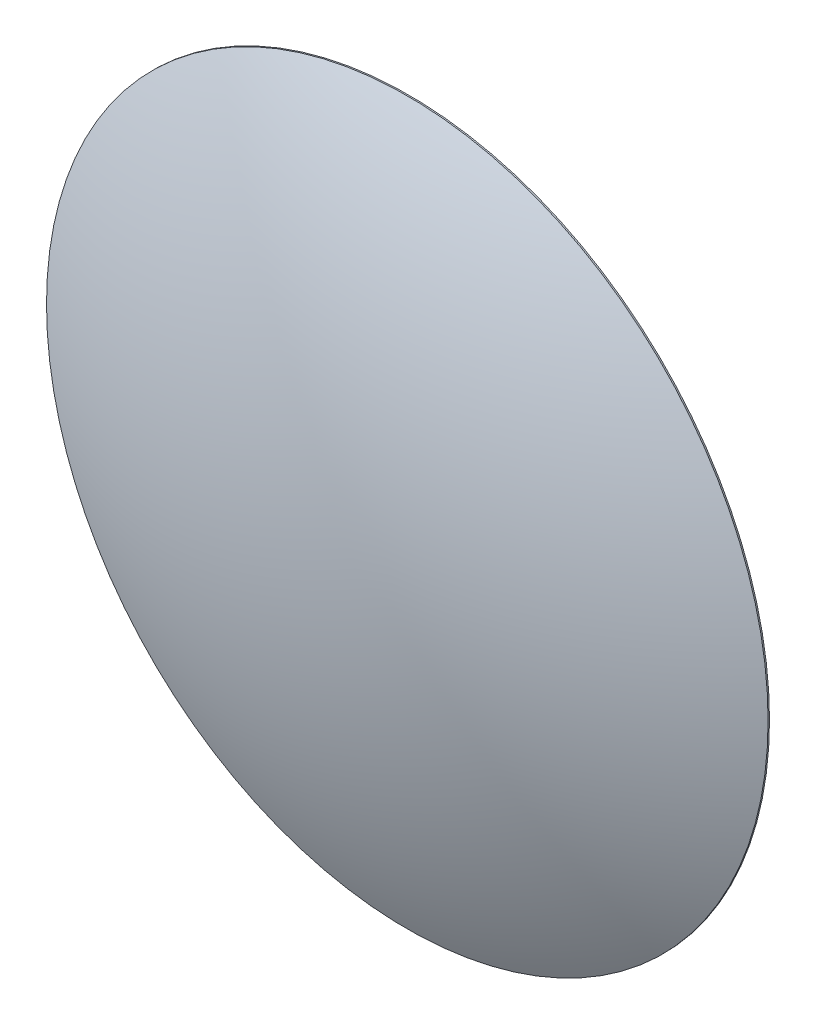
ISO-10303-21;
HEADER;
FILE_DESCRIPTION(('STEP AP214'),'2;1');
FILE_NAME('part.step','',(''),(''),'','','');
FILE_SCHEMA(('AUTOMOTIVE_DESIGN { 1 0 10303 214 1 1 1 1 }'));
ENDSEC;
DATA;
#1=APPLICATION_CONTEXT('core data for automotive mechanical design processes');
#2=APPLICATION_PROTOCOL_DEFINITION('international standard','automotive_design',2000,#1);
#3=PRODUCT_CONTEXT('',#1,'mechanical');
#4=PRODUCT('Part','Part','',(#3));
#5=PRODUCT_RELATED_PRODUCT_CATEGORY('part','',(#4));
#6=PRODUCT_DEFINITION_FORMATION('','',#4);
#7=PRODUCT_DEFINITION_CONTEXT('part definition',#1,'design');
#8=PRODUCT_DEFINITION('design','',#6,#7);
#9=PRODUCT_DEFINITION_SHAPE('','',#8);
#10=(LENGTH_UNIT() NAMED_UNIT(*) SI_UNIT(.MILLI.,.METRE.));
#11=(NAMED_UNIT(*) PLANE_ANGLE_UNIT() SI_UNIT($,.RADIAN.));
#12=(NAMED_UNIT(*) SI_UNIT($,.STERADIAN.) SOLID_ANGLE_UNIT());
#13=UNCERTAINTY_MEASURE_WITH_UNIT(LENGTH_MEASURE(1.E-05),#10,'distance_accuracy_value','');
#14=(GEOMETRIC_REPRESENTATION_CONTEXT(3) GLOBAL_UNCERTAINTY_ASSIGNED_CONTEXT((#13)) GLOBAL_UNIT_ASSIGNED_CONTEXT((#10,
#11,#12)) REPRESENTATION_CONTEXT('',''));
#15=CARTESIAN_POINT('',(0.,0.,0.));
#16=DIRECTION('',(0.,0.,1.));
#17=DIRECTION('',(1.,0.,0.));
#18=AXIS2_PLACEMENT_3D('',#15,#16,#17);
#19=CARTESIAN_POINT('',(0.,0.,-2.));
#20=DIRECTION('',(0.,0.,1.));
#21=DIRECTION('',(1.,0.,0.));
#22=AXIS2_PLACEMENT_3D('',#19,#20,#21);
#23=CYLINDRICAL_SURFACE('',#22,510.);
#24=CARTESIAN_POINT('',(0.,0.,-2.));
#25=DIRECTION('',(0.,0.,1.));
#26=DIRECTION('',(1.,0.,0.));
#27=AXIS2_PLACEMENT_3D('',#24,#25,#26);
#28=CIRCLE('',#27,510.);
#29=CARTESIAN_POINT('',(510.,0.,-2.));
#30=VERTEX_POINT('',#29);
#31=EDGE_CURVE('E10',#30,#30,#28,.T.);
#32=ORIENTED_EDGE('',*,*,#31,.T.);
#33=EDGE_LOOP('',(#32));
#34=FACE_BOUND('',#33,.T.);
#35=CARTESIAN_POINT('',(0.,0.,0.));
#36=DIRECTION('',(0.,0.,1.));
#37=DIRECTION('',(1.,0.,0.));
#38=AXIS2_PLACEMENT_3D('',#35,#36,#37);
#39=CIRCLE('',#38,510.);
#40=CARTESIAN_POINT('',(510.,0.,0.));
#41=VERTEX_POINT('',#40);
#42=EDGE_CURVE('E41',#41,#41,#39,.T.);
#43=ORIENTED_EDGE('',*,*,#42,.F.);
#44=EDGE_LOOP('',(#43));
#45=FACE_BOUND('',#44,.T.);
#46=ADVANCED_FACE('F37',(#34,#45),#23,.T.);
#47=CARTESIAN_POINT('',(0.,0.,-2.));
#48=DIRECTION('',(0.,0.,1.));
#49=DIRECTION('',(1.,0.,0.));
#50=AXIS2_PLACEMENT_3D('',#47,#48,#49);
#51=PLANE('',#50);
#52=CARTESIAN_POINT('',(0.,0.,-2.));
#53=DIRECTION('',(0.,0.,1.));
#54=DIRECTION('',(1.,0.,0.));
#55=AXIS2_PLACEMENT_3D('',#52,#53,#54);
#56=CIRCLE('',#55,507.);
#57=CARTESIAN_POINT('',(507.,0.,-2.));
#58=VERTEX_POINT('',#57);
#59=EDGE_CURVE('E48',#58,#58,#56,.T.);
#60=ORIENTED_EDGE('',*,*,#59,.T.);
#61=EDGE_LOOP('',(#60));
#62=FACE_BOUND('',#61,.T.);
#63=ORIENTED_EDGE('',*,*,#31,.F.);
#64=EDGE_LOOP('',(#63));
#65=FACE_BOUND('',#64,.T.);
#66=ADVANCED_FACE('F68',(#62,#65),#51,.F.);
#67=CARTESIAN_POINT('',(0.,0.,-1023.75));
#68=DIRECTION('',(0.,0.,1.));
#69=DIRECTION('',(1.,0.,0.));
#70=AXIS2_PLACEMENT_3D('',#67,#68,#69);
#71=SPHERICAL_SURFACE('',#70,1143.75);
#72=ORIENTED_EDGE('',*,*,#42,.T.);
#73=EDGE_LOOP('',(#72));
#74=FACE_BOUND('',#73,.T.);
#75=ADVANCED_FACE('F39',(#74),#71,.T.);
#76=CARTESIAN_POINT('',(0.,0.,-2.));
#77=DIRECTION('',(0.,0.,1.));
#78=DIRECTION('',(1.,0.,0.));
#79=AXIS2_PLACEMENT_3D('',#76,#77,#78);
#80=CYLINDRICAL_SURFACE('',#79,507.);
#81=ORIENTED_EDGE('',*,*,#59,.F.);
#82=EDGE_LOOP('',(#81));
#83=FACE_BOUND('',#82,.T.);
#84=CARTESIAN_POINT('',(0.,0.,-1.8588304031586));
#85=DIRECTION('',(0.,0.,-1.));
#86=DIRECTION('',(-1.,0.,0.));
#87=AXIS2_PLACEMENT_3D('',#84,#85,#86);
#88=CIRCLE('',#87,507.);
#89=CARTESIAN_POINT('',(-507.,0.,-1.8588304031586));
#90=VERTEX_POINT('',#89);
#91=EDGE_CURVE('E52',#90,#90,#88,.F.);
#92=ORIENTED_EDGE('',*,*,#91,.T.);
#93=EDGE_LOOP('',(#92));
#94=FACE_BOUND('',#93,.T.);
#95=ADVANCED_FACE('F56',(#83,#94),#80,.F.);
#96=CARTESIAN_POINT('',(0.,0.,-1023.75));
#97=DIRECTION('',(0.,0.,1.));
#98=DIRECTION('',(1.,0.,0.));
#99=AXIS2_PLACEMENT_3D('',#96,#97,#98);
#100=SPHERICAL_SURFACE('',#99,1140.75);
#101=ORIENTED_EDGE('',*,*,#91,.F.);
#102=EDGE_LOOP('',(#101));
#103=FACE_BOUND('',#102,.T.);
#104=ADVANCED_FACE('F58',(#103),#100,.F.);
#105=CLOSED_SHELL('',(#46,#66,#75,#95,#104));
#106=MANIFOLD_SOLID_BREP('B2',#105);
#107=ADVANCED_BREP_SHAPE_REPRESENTATION('',(#18,#106),#14);
#108=SHAPE_DEFINITION_REPRESENTATION(#9,#107);
ENDSEC;
END-ISO-10303-21;
